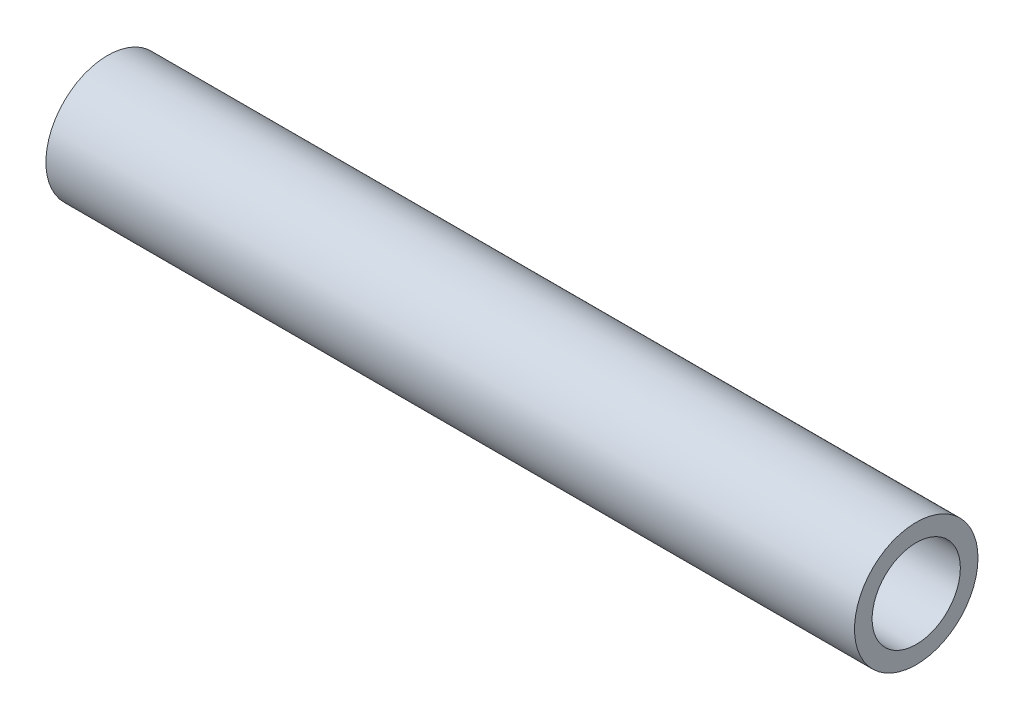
ISO-10303-21;
HEADER;
FILE_DESCRIPTION(('STEP AP214'),'2;1');
FILE_NAME('part.step','',(''),(''),'','','');
FILE_SCHEMA(('AUTOMOTIVE_DESIGN { 1 0 10303 214 1 1 1 1 }'));
ENDSEC;
DATA;
#1=APPLICATION_CONTEXT('core data for automotive mechanical design processes');
#2=APPLICATION_PROTOCOL_DEFINITION('international standard','automotive_design',2000,#1);
#3=PRODUCT_CONTEXT('',#1,'mechanical');
#4=PRODUCT('Part','Part','',(#3));
#5=PRODUCT_RELATED_PRODUCT_CATEGORY('part','',(#4));
#6=PRODUCT_DEFINITION_FORMATION('','',#4);
#7=PRODUCT_DEFINITION_CONTEXT('part definition',#1,'design');
#8=PRODUCT_DEFINITION('design','',#6,#7);
#9=PRODUCT_DEFINITION_SHAPE('','',#8);
#10=(LENGTH_UNIT() NAMED_UNIT(*) SI_UNIT(.MILLI.,.METRE.));
#11=(NAMED_UNIT(*) PLANE_ANGLE_UNIT() SI_UNIT($,.RADIAN.));
#12=(NAMED_UNIT(*) SI_UNIT($,.STERADIAN.) SOLID_ANGLE_UNIT());
#13=UNCERTAINTY_MEASURE_WITH_UNIT(LENGTH_MEASURE(1.E-05),#10,'distance_accuracy_value','');
#14=(GEOMETRIC_REPRESENTATION_CONTEXT(3) GLOBAL_UNCERTAINTY_ASSIGNED_CONTEXT((#13)) GLOBAL_UNIT_ASSIGNED_CONTEXT((#10,
#11,#12)) REPRESENTATION_CONTEXT('',''));
#15=CARTESIAN_POINT('',(0.,0.,0.));
#16=DIRECTION('',(0.,0.,1.));
#17=DIRECTION('',(1.,0.,0.));
#18=AXIS2_PLACEMENT_3D('',#15,#16,#17);
#19=CARTESIAN_POINT('',(139.7,0.,0.));
#20=DIRECTION('',(-1.,0.,0.));
#21=DIRECTION('',(0.,0.,1.));
#22=AXIS2_PLACEMENT_3D('',#19,#20,#21);
#23=CYLINDRICAL_SURFACE('',#22,7.62);
#24=CARTESIAN_POINT('',(139.7,0.,0.));
#25=DIRECTION('',(1.,0.,0.));
#26=DIRECTION('',(0.,0.,-1.));
#27=AXIS2_PLACEMENT_3D('',#24,#25,#26);
#28=CIRCLE('',#27,7.62);
#29=CARTESIAN_POINT('',(139.7,0.,-7.62));
#30=VERTEX_POINT('',#29);
#31=EDGE_CURVE('E53',#30,#30,#28,.T.);
#32=ORIENTED_EDGE('',*,*,#31,.T.);
#33=EDGE_LOOP('',(#32));
#34=FACE_BOUND('',#33,.T.);
#35=CARTESIAN_POINT('',(0.,0.,0.));
#36=DIRECTION('',(1.,0.,0.));
#37=DIRECTION('',(0.,0.,-1.));
#38=AXIS2_PLACEMENT_3D('',#35,#36,#37);
#39=CIRCLE('',#38,7.62);
#40=CARTESIAN_POINT('',(0.,0.,-7.62));
#41=VERTEX_POINT('',#40);
#42=EDGE_CURVE('E60',#41,#41,#39,.T.);
#43=ORIENTED_EDGE('',*,*,#42,.F.);
#44=EDGE_LOOP('',(#43));
#45=FACE_BOUND('',#44,.T.);
#46=ADVANCED_FACE('F45',(#34,#45),#23,.F.);
#47=CARTESIAN_POINT('',(139.7,0.,0.));
#48=DIRECTION('',(-1.,0.,0.));
#49=DIRECTION('',(0.,0.,1.));
#50=AXIS2_PLACEMENT_3D('',#47,#48,#49);
#51=CYLINDRICAL_SURFACE('',#50,10.668);
#52=CARTESIAN_POINT('',(139.7,0.,0.));
#53=DIRECTION('',(1.,0.,0.));
#54=DIRECTION('',(0.,0.,-1.));
#55=AXIS2_PLACEMENT_3D('',#52,#53,#54);
#56=CIRCLE('',#55,10.668);
#57=CARTESIAN_POINT('',(139.7,0.,-10.668));
#58=VERTEX_POINT('',#57);
#59=EDGE_CURVE('E10',#58,#58,#56,.T.);
#60=ORIENTED_EDGE('',*,*,#59,.F.);
#61=EDGE_LOOP('',(#60));
#62=FACE_BOUND('',#61,.T.);
#63=CARTESIAN_POINT('',(0.,0.,0.));
#64=DIRECTION('',(1.,0.,0.));
#65=DIRECTION('',(0.,0.,-1.));
#66=AXIS2_PLACEMENT_3D('',#63,#64,#65);
#67=CIRCLE('',#66,10.668);
#68=CARTESIAN_POINT('',(0.,0.,-10.668));
#69=VERTEX_POINT('',#68);
#70=EDGE_CURVE('E48',#69,#69,#67,.T.);
#71=ORIENTED_EDGE('',*,*,#70,.T.);
#72=EDGE_LOOP('',(#71));
#73=FACE_BOUND('',#72,.T.);
#74=ADVANCED_FACE('F69',(#62,#73),#51,.T.);
#75=CARTESIAN_POINT('',(139.7,0.,0.));
#76=DIRECTION('',(1.,0.,0.));
#77=DIRECTION('',(0.,0.,-1.));
#78=AXIS2_PLACEMENT_3D('',#75,#76,#77);
#79=PLANE('',#78);
#80=ORIENTED_EDGE('',*,*,#31,.F.);
#81=EDGE_LOOP('',(#80));
#82=FACE_BOUND('',#81,.T.);
#83=ORIENTED_EDGE('',*,*,#59,.T.);
#84=EDGE_LOOP('',(#83));
#85=FACE_BOUND('',#84,.T.);
#86=ADVANCED_FACE('F73',(#82,#85),#79,.T.);
#87=CARTESIAN_POINT('',(0.,0.,0.));
#88=DIRECTION('',(1.,0.,0.));
#89=DIRECTION('',(0.,0.,-1.));
#90=AXIS2_PLACEMENT_3D('',#87,#88,#89);
#91=PLANE('',#90);
#92=ORIENTED_EDGE('',*,*,#42,.T.);
#93=EDGE_LOOP('',(#92));
#94=FACE_BOUND('',#93,.T.);
#95=ORIENTED_EDGE('',*,*,#70,.F.);
#96=EDGE_LOOP('',(#95));
#97=FACE_BOUND('',#96,.T.);
#98=ADVANCED_FACE('F71',(#94,#97),#91,.F.);
#99=CLOSED_SHELL('',(#46,#74,#86,#98));
#100=MANIFOLD_SOLID_BREP('B2',#99);
#101=ADVANCED_BREP_SHAPE_REPRESENTATION('',(#18,#100),#14);
#102=SHAPE_DEFINITION_REPRESENTATION(#9,#101);
ENDSEC;
END-ISO-10303-21;
